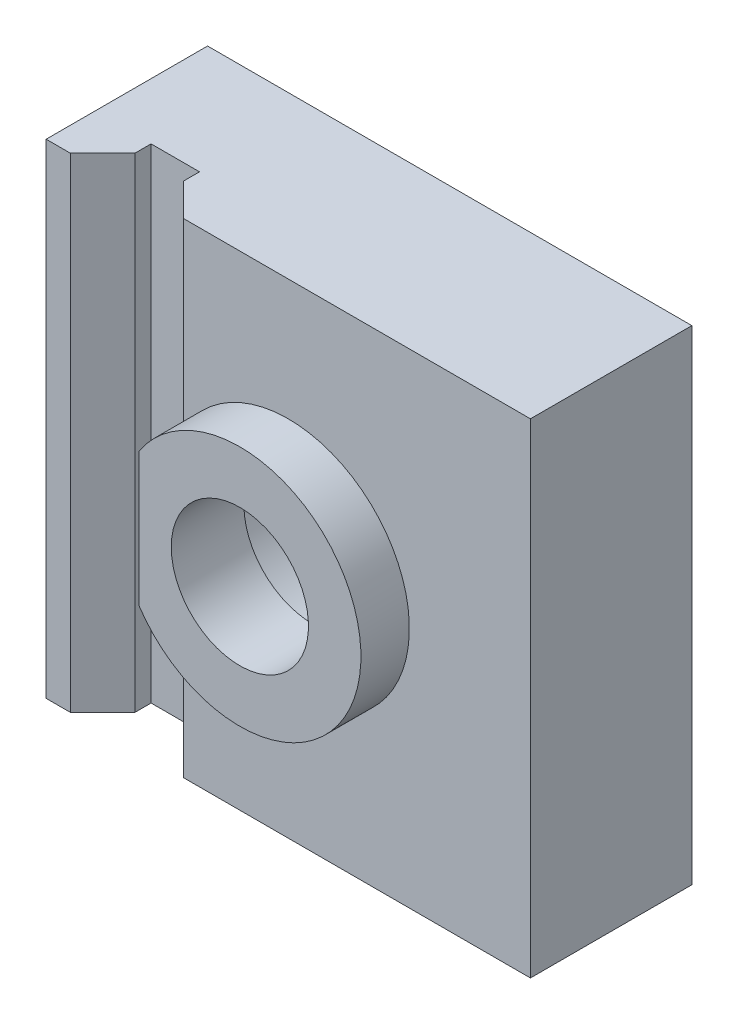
from build123d import *

# Parameters (mm, degrees)
SKIZZE1_W                                            = 30
SKIZZE1_H                                            = 30
AUFSATZ_LINEAR_AUSTRAGEN1_DEPTH                      = 10
AUFSATZ_LINEAR_AUSTRAGEN2_DEPTH                      = 3
STIRNSENKUNG_F_R_M5_ZYLINDERSCHRAUBE_MIT_D           = 8.5
STIRNSENKUNG_F_R_M5_ZYLINDERSCHRAUBE_MIT_CBORE_D     = 13.5
STIRNSENKUNG_F_R_M5_ZYLINDERSCHRAUBE_MIT_CBORE_DEPTH = 8.5
SCHNITT_LINEAR_AUSTRAGEN1_DEPTH                      = 36.972211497


with BuildPart() as part:
    # Skizze1 → Aufsatz-Linear austragen1 (new body)
    with BuildSketch(Plane.XY):
        Rectangle(SKIZZE1_W, SKIZZE1_H)
    extrude(amount=AUFSATZ_LINEAR_AUSTRAGEN1_DEPTH)

    # Skizze2 → Aufsatz-Linear austragen2 (add)
    with BuildSketch(Plane.XY.offset(10)):
        with BuildLine():
            Line((-6.25, -4.145780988), (-6.25, 4.145780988))
            ThreePointArc((-6.25, 4.145780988), (7.5, 0), (-6.25, -4.145780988))
        make_face()
    extrude(amount=AUFSATZ_LINEAR_AUSTRAGEN2_DEPTH)

    # Stirnsenkung f_r M5 Zylinderschraube mit (through all)
    with Locations(Plane(origin=(0, 0, 0), x_dir=(-1, 0, 0), z_dir=(0, 0, -1))):
        with Locations((0, 0)):
            CounterBoreHole(STIRNSENKUNG_F_R_M5_ZYLINDERSCHRAUBE_MIT_D / 2, STIRNSENKUNG_F_R_M5_ZYLINDERSCHRAUBE_MIT_CBORE_D / 2, STIRNSENKUNG_F_R_M5_ZYLINDERSCHRAUBE_MIT_CBORE_DEPTH)

    # Skizze6 → Schnitt-Linear austragen1 (cut, through all)
    with BuildSketch(Plane(origin=(0, 15, 0), x_dir=(1, 0, 0), z_dir=(0, 1, 0))):
        Polygon((-13.5, -10), (-11.5, -8), (-11.5, -7), (-8.5, -7), (-8.5, -8), (-6.5, -10), align=None)
    extrude(amount=-SCHNITT_LINEAR_AUSTRAGEN1_DEPTH, mode=Mode.SUBTRACT)


solid = part.part
